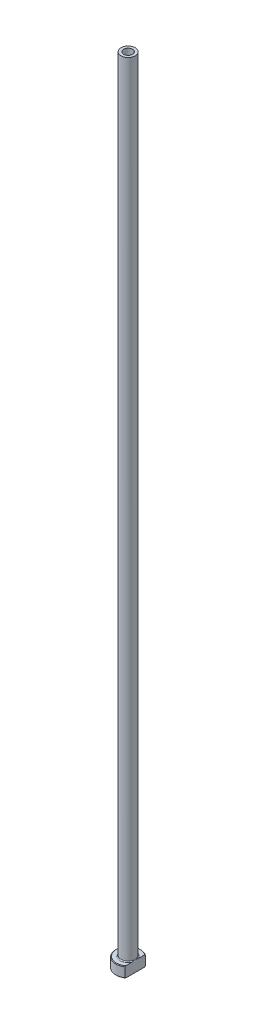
ISO-10303-21;
HEADER;
FILE_DESCRIPTION(('STEP AP214'),'2;1');
FILE_NAME('part.step','',(''),(''),'','','');
FILE_SCHEMA(('AUTOMOTIVE_DESIGN { 1 0 10303 214 1 1 1 1 }'));
ENDSEC;
DATA;
#1=APPLICATION_CONTEXT('core data for automotive mechanical design processes');
#2=APPLICATION_PROTOCOL_DEFINITION('international standard','automotive_design',2000,#1);
#3=PRODUCT_CONTEXT('',#1,'mechanical');
#4=PRODUCT('Part','Part','',(#3));
#5=PRODUCT_RELATED_PRODUCT_CATEGORY('part','',(#4));
#6=PRODUCT_DEFINITION_FORMATION('','',#4);
#7=PRODUCT_DEFINITION_CONTEXT('part definition',#1,'design');
#8=PRODUCT_DEFINITION('design','',#6,#7);
#9=PRODUCT_DEFINITION_SHAPE('','',#8);
#10=(LENGTH_UNIT() NAMED_UNIT(*) SI_UNIT(.MILLI.,.METRE.));
#11=(NAMED_UNIT(*) PLANE_ANGLE_UNIT() SI_UNIT($,.RADIAN.));
#12=(NAMED_UNIT(*) SI_UNIT($,.STERADIAN.) SOLID_ANGLE_UNIT());
#13=UNCERTAINTY_MEASURE_WITH_UNIT(LENGTH_MEASURE(1.E-05),#10,'distance_accuracy_value','');
#14=(GEOMETRIC_REPRESENTATION_CONTEXT(3) GLOBAL_UNCERTAINTY_ASSIGNED_CONTEXT((#13)) GLOBAL_UNIT_ASSIGNED_CONTEXT((#10,
#11,#12)) REPRESENTATION_CONTEXT('',''));
#15=CARTESIAN_POINT('',(0.,0.,0.));
#16=DIRECTION('',(0.,0.,1.));
#17=DIRECTION('',(1.,0.,0.));
#18=AXIS2_PLACEMENT_3D('',#15,#16,#17);
#19=CARTESIAN_POINT('',(0.,0.,0.));
#20=DIRECTION('',(0.,-1.,0.));
#21=DIRECTION('',(0.,0.,-1.));
#22=AXIS2_PLACEMENT_3D('',#19,#20,#21);
#23=PLANE('',#22);
#24=DIRECTION('',(0.,0.,-1.));
#25=VECTOR('',#24,1.);
#26=CARTESIAN_POINT('',(3.16865,0.,4.5564292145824));
#27=LINE('',#26,#25);
#28=CARTESIAN_POINT('',(3.16865,0.,4.2433729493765));
#29=VERTEX_POINT('',#28);
#30=CARTESIAN_POINT('',(3.16865,0.,-4.2433729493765));
#31=VERTEX_POINT('',#30);
#32=EDGE_CURVE('E79',#29,#31,#27,.T.);
#33=ORIENTED_EDGE('',*,*,#32,.F.);
#34=CARTESIAN_POINT('',(0.,0.,0.));
#35=DIRECTION('',(0.,-1.,0.));
#36=DIRECTION('',(0.,0.,-1.));
#37=AXIS2_PLACEMENT_3D('',#34,#35,#36);
#38=CIRCLE('',#37,5.29590000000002);
#39=EDGE_CURVE('E91',#29,#31,#38,.T.);
#40=ORIENTED_EDGE('',*,*,#39,.T.);
#41=EDGE_LOOP('',(#33,#40));
#42=FACE_BOUND('',#41,.T.);
#43=CARTESIAN_POINT('',(0.,0.,0.));
#44=DIRECTION('',(0.,-1.,0.));
#45=DIRECTION('',(0.,0.,-1.));
#46=AXIS2_PLACEMENT_3D('',#43,#44,#45);
#47=CIRCLE('',#46,2.57111500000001);
#48=CARTESIAN_POINT('',(0.,0.,-2.57111500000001));
#49=VERTEX_POINT('',#48);
#50=EDGE_CURVE('E157',#49,#49,#47,.T.);
#51=ORIENTED_EDGE('',*,*,#50,.F.);
#52=EDGE_LOOP('',(#51));
#53=FACE_BOUND('',#52,.T.);
#54=ADVANCED_FACE('F32',(#42,#53),#23,.T.);
#55=CARTESIAN_POINT('',(0.,0.,0.));
#56=DIRECTION('',(0.,-1.,0.));
#57=DIRECTION('',(0.,0.,-1.));
#58=AXIS2_PLACEMENT_3D('',#55,#56,#57);
#59=CYLINDRICAL_SURFACE('',#58,5.5499);
#60=DIRECTION('',(0.,-1.,0.));
#61=VECTOR('',#60,1.);
#62=CARTESIAN_POINT('',(3.16865,355.601,-4.5564292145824));
#63=LINE('',#62,#61);
#64=CARTESIAN_POINT('',(3.16865,4.49579999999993,-4.5564292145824));
#65=VERTEX_POINT('',#64);
#66=CARTESIAN_POINT('',(3.16865,0.253999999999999,-4.5564292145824));
#67=VERTEX_POINT('',#66);
#68=EDGE_CURVE('E108',#65,#67,#63,.T.);
#69=ORIENTED_EDGE('',*,*,#68,.T.);
#70=CARTESIAN_POINT('',(0.,0.253999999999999,0.));
#71=DIRECTION('',(0.,-1.,0.));
#72=DIRECTION('',(0.,0.,-1.));
#73=AXIS2_PLACEMENT_3D('',#70,#71,#72);
#74=CIRCLE('',#73,5.5499);
#75=CARTESIAN_POINT('',(3.16865,0.253999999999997,4.5564292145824));
#76=VERTEX_POINT('',#75);
#77=EDGE_CURVE('E40',#67,#76,#74,.F.);
#78=ORIENTED_EDGE('',*,*,#77,.T.);
#79=DIRECTION('',(0.,-1.,0.));
#80=VECTOR('',#79,1.);
#81=CARTESIAN_POINT('',(3.16865,355.601,4.5564292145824));
#82=LINE('',#81,#80);
#83=CARTESIAN_POINT('',(3.16865,4.49579999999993,4.5564292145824));
#84=VERTEX_POINT('',#83);
#85=EDGE_CURVE('E86',#84,#76,#82,.T.);
#86=ORIENTED_EDGE('',*,*,#85,.F.);
#87=CARTESIAN_POINT('',(0.,4.49579999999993,0.));
#88=DIRECTION('',(0.,1.,0.));
#89=DIRECTION('',(0.,0.,1.));
#90=AXIS2_PLACEMENT_3D('',#87,#88,#89);
#91=CIRCLE('',#90,5.5499);
#92=EDGE_CURVE('E95',#84,#65,#91,.F.);
#93=ORIENTED_EDGE('',*,*,#92,.T.);
#94=EDGE_LOOP('',(#69,#78,#86,#93));
#95=FACE_BOUND('',#94,.T.);
#96=ADVANCED_FACE('F106',(#95),#59,.T.);
#97=CARTESIAN_POINT('',(5.5499,4.7498,0.));
#98=DIRECTION('',(0.,1.,0.));
#99=DIRECTION('',(0.,0.,1.));
#100=AXIS2_PLACEMENT_3D('',#97,#98,#99);
#101=PLANE('',#100);
#102=DIRECTION('',(0.,0.,-1.));
#103=VECTOR('',#102,1.);
#104=CARTESIAN_POINT('',(3.16865,4.74980000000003,4.5564292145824));
#105=LINE('',#104,#103);
#106=CARTESIAN_POINT('',(3.16865,4.7498,-1.63481671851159));
#107=VERTEX_POINT('',#106);
#108=CARTESIAN_POINT('',(3.16865,4.7498,-4.24337294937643));
#109=VERTEX_POINT('',#108);
#110=EDGE_CURVE('E112',#107,#109,#105,.T.);
#111=ORIENTED_EDGE('',*,*,#110,.T.);
#112=CARTESIAN_POINT('',(0.,4.7498,0.));
#113=DIRECTION('',(0.,1.,0.));
#114=DIRECTION('',(0.,0.,1.));
#115=AXIS2_PLACEMENT_3D('',#112,#113,#114);
#116=CIRCLE('',#115,5.29589999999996);
#117=CARTESIAN_POINT('',(3.16865,4.7498,4.24337294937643));
#118=VERTEX_POINT('',#117);
#119=EDGE_CURVE('E11',#109,#118,#116,.T.);
#120=ORIENTED_EDGE('',*,*,#119,.T.);
#121=CARTESIAN_POINT('',(3.16864999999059,4.7498,1.63481671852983));
#122=VERTEX_POINT('',#121);
#123=EDGE_CURVE('E47',#118,#122,#105,.T.);
#124=ORIENTED_EDGE('',*,*,#123,.T.);
#125=CARTESIAN_POINT('',(0.,4.7498,0.));
#126=DIRECTION('',(0.,-1.,0.));
#127=DIRECTION('',(0.,0.,-1.));
#128=AXIS2_PLACEMENT_3D('',#125,#126,#127);
#129=CIRCLE('',#128,3.565525);
#130=EDGE_CURVE('E96',#122,#107,#129,.T.);
#131=ORIENTED_EDGE('',*,*,#130,.T.);
#132=EDGE_LOOP('',(#111,#120,#124,#131));
#133=FACE_BOUND('',#132,.T.);
#134=ADVANCED_FACE('F182',(#133),#101,.T.);
#135=CARTESIAN_POINT('',(0.,5.146675,0.));
#136=DIRECTION('',(0.,-1.,0.));
#137=DIRECTION('',(0.,0.,-1.));
#138=AXIS2_PLACEMENT_3D('',#135,#136,#137);
#139=TOROIDAL_SURFACE('',#138,3.565525,0.396875);
#140=CARTESIAN_POINT('',(3.16865,5.146675,0.));
#141=CARTESIAN_POINT('',(3.16865,5.14667428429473,4.66277788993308E-11));
#142=CARTESIAN_POINT('',(3.16865,5.14667356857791,-1.78482733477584E-07));
#143=CARTESIAN_POINT('',(3.16865,5.14667220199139,-7.25003186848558E-07));
#144=CARTESIAN_POINT('',(3.16865,5.14667155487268,-1.10030424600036E-06));
#145=CARTESIAN_POINT('',(3.16865,5.14667025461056,-1.99813404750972E-06));
#146=CARTESIAN_POINT('',(3.16865,5.14666960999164,-2.53289842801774E-06));
#147=CARTESIAN_POINT('',(3.16865,5.14666840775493,-3.67424467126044E-06));
#148=CARTESIAN_POINT('',(3.16865,5.14666784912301,-4.27981221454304E-06));
#149=CARTESIAN_POINT('',(3.16865,5.14666592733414,-6.49333135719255E-06));
#150=CARTESIAN_POINT('',(3.16865,5.14666466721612,-8.19260530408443E-06));
#151=CARTESIAN_POINT('',(3.16865,5.1466624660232,-1.16647175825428E-05));
#152=CARTESIAN_POINT('',(3.16865,5.14666151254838,-1.3430122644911E-05));
#153=CARTESIAN_POINT('',(3.16865,5.14665782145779,-2.04765522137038E-05));
#154=CARTESIAN_POINT('',(3.16865,5.14665525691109,-2.58538058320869E-05));
#155=CARTESIAN_POINT('',(3.16865,5.14665117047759,-3.63358801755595E-05));
#156=CARTESIAN_POINT('',(3.16865,5.14664956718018,-4.14096713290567E-05));
#157=CARTESIAN_POINT('',(3.16865,5.14664257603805,-6.34443713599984E-05));
#158=CARTESIAN_POINT('',(3.16865,5.14663713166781,-8.03743565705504E-05));
#159=CARTESIAN_POINT('',(3.16865,5.14662857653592,-0.000111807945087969));
#160=CARTESIAN_POINT('',(3.16865,5.146625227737,-0.000126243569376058));
#161=CARTESIAN_POINT('',(3.16865,5.14659823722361,-0.000232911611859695));
#162=CARTESIAN_POINT('',(3.16865,5.1465631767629,-0.000321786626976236));
#163=CARTESIAN_POINT('',(3.16865,5.14643076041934,-0.000670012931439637));
#164=CARTESIAN_POINT('',(3.16865,5.14634192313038,-0.000931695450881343));
#165=CARTESIAN_POINT('',(3.16865,5.14598882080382,-0.00195689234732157));
#166=CARTESIAN_POINT('',(3.16865,5.14571562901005,-0.00271802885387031));
#167=CARTESIAN_POINT('',(3.16865,5.14459471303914,-0.00585544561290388));
#168=CARTESIAN_POINT('',(3.16865,5.14375704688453,-0.00823433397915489));
#169=CARTESIAN_POINT('',(3.16865,5.13080352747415,-0.045002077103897));
#170=CARTESIAN_POINT('',(3.16865,5.11860522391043,-0.0793699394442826));
#171=CARTESIAN_POINT('',(3.16865,5.09480563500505,-0.146831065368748));
#172=CARTESIAN_POINT('',(3.16865,5.08319937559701,-0.17992273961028));
#173=CARTESIAN_POINT('',(3.16865,5.05872882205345,-0.250160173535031));
#174=CARTESIAN_POINT('',(3.16865,5.04588213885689,-0.287312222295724));
#175=CARTESIAN_POINT('',(3.16865,5.02034575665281,-0.362107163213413));
#176=CARTESIAN_POINT('',(3.16865,5.00765913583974,-0.399751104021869));
#177=CARTESIAN_POINT('',(3.16865,4.97701497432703,-0.492297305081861));
#178=CARTESIAN_POINT('',(3.16865,4.95928003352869,-0.547273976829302));
#179=CARTESIAN_POINT('',(3.16865,4.92542952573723,-0.656258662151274));
#180=CARTESIAN_POINT('',(3.16865,4.90928503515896,-0.710257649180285));
#181=CARTESIAN_POINT('',(3.16865,4.87522411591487,-0.83024121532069));
#182=CARTESIAN_POINT('',(3.16865,4.85766300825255,-0.896328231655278));
#183=CARTESIAN_POINT('',(3.16865,4.82539191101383,-1.02974197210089));
#184=CARTESIAN_POINT('',(3.16865,4.8107048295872,-1.09707431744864));
#185=CARTESIAN_POINT('',(3.16865,4.7843808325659,-1.23739352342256));
#186=CARTESIAN_POINT('',(3.16865,4.77304014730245,-1.31043808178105));
#187=CARTESIAN_POINT('',(3.16865,4.75646723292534,-1.45702765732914));
#188=CARTESIAN_POINT('',(3.16865,4.75121678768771,-1.53057051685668));
#189=CARTESIAN_POINT('',(3.16865,4.74889461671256,-1.67644419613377));
#190=CARTESIAN_POINT('',(3.16865,4.75166022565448,-1.74876957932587));
#191=CARTESIAN_POINT('',(3.16865,4.76391149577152,-1.85572284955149));
#192=CARTESIAN_POINT('',(3.16865,4.769266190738,-1.89082342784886));
#193=CARTESIAN_POINT('',(3.16865,4.78314258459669,-1.96037693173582));
#194=CARTESIAN_POINT('',(3.16865,4.79166022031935,-1.99483062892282));
#195=CARTESIAN_POINT('',(3.16865,4.80975826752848,-2.0535593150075));
#196=CARTESIAN_POINT('',(3.16865,4.81845399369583,-2.07810503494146));
#197=CARTESIAN_POINT('',(3.16865,4.83829308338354,-2.12629920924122));
#198=CARTESIAN_POINT('',(3.16865,4.84944408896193,-2.14994458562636));
#199=CARTESIAN_POINT('',(3.16865,4.87468634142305,-2.1958922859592));
#200=CARTESIAN_POINT('',(3.16865,4.88880103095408,-2.21818195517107));
#201=CARTESIAN_POINT('',(3.16865,4.92035751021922,-2.26026315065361));
#202=CARTESIAN_POINT('',(3.16865,4.93778918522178,-2.28006197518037));
#203=CARTESIAN_POINT('',(3.16865,4.96922967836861,-2.30918918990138));
#204=CARTESIAN_POINT('',(3.16865,4.98214531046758,-2.31969288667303));
#205=CARTESIAN_POINT('',(3.16865,5.00943424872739,-2.33863002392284));
#206=CARTESIAN_POINT('',(3.16865,5.02380699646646,-2.34706425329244));
#207=CARTESIAN_POINT('',(3.16865,5.05400337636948,-2.361360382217));
#208=CARTESIAN_POINT('',(3.16865,5.069841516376,-2.36719226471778));
#209=CARTESIAN_POINT('',(3.16865,5.10236414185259,-2.37556876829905));
#210=CARTESIAN_POINT('',(3.16865,5.11904735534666,-2.37811818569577));
#211=CARTESIAN_POINT('',(3.16865,5.15012257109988,-2.37953907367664));
#212=CARTESIAN_POINT('',(3.16865,5.1644940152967,-2.37889256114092));
#213=CARTESIAN_POINT('',(3.16865,5.19289291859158,-2.37506178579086));
#214=CARTESIAN_POINT('',(3.16865,5.20692032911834,-2.37187716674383));
#215=CARTESIAN_POINT('',(3.16865,5.23359936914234,-2.36343099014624));
#216=CARTESIAN_POINT('',(3.16865,5.24628466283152,-2.35827364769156));
#217=CARTESIAN_POINT('',(3.16865,5.27077987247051,-2.34620293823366));
#218=CARTESIAN_POINT('',(3.16865,5.28258955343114,-2.33928910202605));
#219=CARTESIAN_POINT('',(3.16865,5.31138945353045,-2.31987573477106));
#220=CARTESIAN_POINT('',(3.16865,5.32770979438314,-2.30638191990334));
#221=CARTESIAN_POINT('',(3.16865,5.35801888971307,-2.2769796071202));
#222=CARTESIAN_POINT('',(3.16865,5.37200054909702,-2.2610640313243));
#223=CARTESIAN_POINT('',(3.16865,5.40512341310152,-2.21806082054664));
#224=CARTESIAN_POINT('',(3.16865,5.42268309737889,-2.18976305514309));
#225=CARTESIAN_POINT('',(3.16865,5.45333663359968,-2.13094239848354));
#226=CARTESIAN_POINT('',(3.16865,5.46642934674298,-2.10041894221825));
#227=CARTESIAN_POINT('',(3.16865,5.48771138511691,-2.0415606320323));
#228=CARTESIAN_POINT('',(3.16865,5.49628469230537,-2.01336128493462));
#229=CARTESIAN_POINT('',(3.16865,5.51099656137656,-1.95632381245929));
#230=CARTESIAN_POINT('',(3.16865,5.51713302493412,-1.92748515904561));
#231=CARTESIAN_POINT('',(3.16865,5.53254859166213,-1.83974814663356));
#232=CARTESIAN_POINT('',(3.16865,5.5386185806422,-1.78028549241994));
#233=CARTESIAN_POINT('',(3.16865,5.54453876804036,-1.65829362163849));
#234=CARTESIAN_POINT('',(3.16865,5.54407710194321,-1.59575395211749));
#235=CARTESIAN_POINT('',(3.16865,5.53781271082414,-1.47080704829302));
#236=CARTESIAN_POINT('',(3.16865,5.53199591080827,-1.40840059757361));
#237=CARTESIAN_POINT('',(3.16865,5.5166154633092,-1.28746485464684));
#238=CARTESIAN_POINT('',(3.16865,5.50726872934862,-1.22890663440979));
#239=CARTESIAN_POINT('',(3.16865,5.48567786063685,-1.11272190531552));
#240=CARTESIAN_POINT('',(3.16865,5.47345247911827,-1.05509184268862));
#241=CARTESIAN_POINT('',(3.16865,5.44328051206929,-0.925795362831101));
#242=CARTESIAN_POINT('',(3.16865,5.42466959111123,-0.854285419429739));
#243=CARTESIAN_POINT('',(3.16865,5.39452813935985,-0.746782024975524));
#244=CARTESIAN_POINT('',(3.16865,5.38398071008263,-0.710505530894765));
#245=CARTESIAN_POINT('',(3.16865,5.36227217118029,-0.638036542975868));
#246=CARTESIAN_POINT('',(3.16865,5.35110958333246,-0.601844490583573));
#247=CARTESIAN_POINT('',(3.16865,5.32417385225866,-0.516533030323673));
#248=CARTESIAN_POINT('',(3.16865,5.3081950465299,-0.467478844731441));
#249=CARTESIAN_POINT('',(3.16865,5.27575939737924,-0.370102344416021));
#250=CARTESIAN_POINT('',(3.16865,5.25930934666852,-0.321777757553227));
#251=CARTESIAN_POINT('',(3.16865,5.22782288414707,-0.23048546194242));
#252=CARTESIAN_POINT('',(3.16865,5.21282608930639,-0.187503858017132));
#253=CARTESIAN_POINT('',(3.16865,5.18200013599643,-0.099892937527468));
#254=CARTESIAN_POINT('',(3.16865000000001,5.16616171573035,-0.0552666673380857));
#255=CARTESIAN_POINT('',(3.16865,5.14959263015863,-0.00823325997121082));
#256=CARTESIAN_POINT('',(3.16865,5.14875455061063,-0.00585332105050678));
#257=CARTESIAN_POINT('',(3.16865,5.14763353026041,-0.00271565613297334));
#258=CARTESIAN_POINT('',(3.16865,5.14736062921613,-0.00195532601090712));
#259=CARTESIAN_POINT('',(3.16865,5.1470078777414,-0.000931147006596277));
#260=CARTESIAN_POINT('',(3.16865,5.14691911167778,-0.000669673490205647));
#261=CARTESIAN_POINT('',(3.16865,5.14678678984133,-0.000321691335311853));
#262=CARTESIAN_POINT('',(3.16865,5.14675174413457,-0.000232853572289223));
#263=CARTESIAN_POINT('',(3.16865,5.146724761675,-0.000126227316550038));
#264=CARTESIAN_POINT('',(3.16865,5.14672141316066,-0.000111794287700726));
#265=CARTESIAN_POINT('',(3.16865,5.14671285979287,-8.03665096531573E-05));
#266=CARTESIAN_POINT('',(3.16865,5.14670741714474,-6.3439670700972E-05));
#267=CARTESIAN_POINT('',(3.16865,5.14670042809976,-4.14084906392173E-05));
#268=CARTESIAN_POINT('',(3.16865,5.1466988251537,-3.63350825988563E-05));
#269=CARTESIAN_POINT('',(3.16865,5.14669473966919,-2.5853746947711E-05));
#270=CARTESIAN_POINT('',(3.16865,5.1466921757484,-2.0476833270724E-05));
#271=CARTESIAN_POINT('',(3.16865,5.14668848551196,-1.34307327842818E-05));
#272=CARTESIAN_POINT('',(3.16865,5.1466875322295,-1.16653571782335E-05));
#273=CARTESIAN_POINT('',(3.16865,5.14668533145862,-8.19326689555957E-06));
#274=CARTESIAN_POINT('',(3.16865,5.14668407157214,-6.49398299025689E-06));
#275=CARTESIAN_POINT('',(3.16865,5.1466821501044,-4.28040648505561E-06));
#276=CARTESIAN_POINT('',(3.16865,5.14668159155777,-3.67481344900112E-06));
#277=CARTESIAN_POINT('',(3.16865,5.14668038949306,-2.5334008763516E-06));
#278=CARTESIAN_POINT('',(3.16865,5.1466797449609,-1.99859540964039E-06));
#279=CARTESIAN_POINT('',(3.16865,5.14667844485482,-1.10066675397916E-06));
#280=CARTESIAN_POINT('',(3.16865,5.14667779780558,-7.25310433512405E-07));
#281=CARTESIAN_POINT('',(3.16865,5.14667643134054,-1.78654653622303E-07));
#282=CARTESIAN_POINT('',(3.16865,5.14667571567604,-4.66240653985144E-11));
#283=CARTESIAN_POINT('',(3.16865,5.146675,0.));
#284=B_SPLINE_CURVE_WITH_KNOTS('',3,(#140,#141,#142,#143,#144,#145,#146,#147,#148,#149,#150,
#151,#152,#153,#154,#155,#156,#157,#158,#159,#160,#161,#162,#163,#164,#165,#166,#167,#168,#169,
#170,#171,#172,#173,#174,#175,#176,#177,#178,#179,#180,#181,#182,#183,#184,#185,#186,#187,#188,
#189,#190,#191,#192,#193,#194,#195,#196,#197,#198,#199,#200,#201,#202,#203,#204,#205,#206,#207,
#208,#209,#210,#211,#212,#213,#214,#215,#216,#217,#218,#219,#220,#221,#222,#223,#224,#225,#226,
#227,#228,#229,#230,#231,#232,#233,#234,#235,#236,#237,#238,#239,#240,#241,#242,#243,#244,#245,
#246,#247,#248,#249,#250,#251,#252,#253,#254,#255,#256,#257,#258,#259,#260,#261,#262,#263,#264,
#265,#266,#267,#268,#269,#270,#271,#272,#273,#274,#275,#276,#277,#278,#279,#280,#281,#282,#283),
.UNSPECIFIED.,.T.,.F.,(4,2,2,2,2,2,2,2,2,2,2,2,2,2,2,2,2,2,2,2,2,2,2,2,2,2,2,2,2,2,2,2,2,2,2,2,
2,2,2,2,2,2,2,2,2,2,2,2,2,2,2,2,2,2,2,2,2,2,2,2,2,2,2,2,2,2,2,2,2,2,2,4),(0.,
2.1481731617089E-06,4.3824835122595E-06,6.8838453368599E-06,9.35297220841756E-06,
1.56702799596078E-05,2.16847026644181E-05,3.95092655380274E-05,5.54549698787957E-05,
0.000108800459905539,0.000153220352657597,0.00043893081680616,0.0012687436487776,
0.00369382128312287,0.0112610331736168,0.120656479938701,0.225862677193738,0.343792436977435,
0.46296418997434,0.636252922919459,0.805320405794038,1.0104086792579,1.21707043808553,
1.43863106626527,1.65952727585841,1.87597253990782,1.98238468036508,2.08866059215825,
2.16668016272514,2.24494609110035,2.3238561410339,2.40252931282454,2.45231667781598,
2.50208503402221,2.55241348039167,2.60266830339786,2.6455965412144,2.68853080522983,
2.72945503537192,2.77039020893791,2.83355766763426,2.89691341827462,2.9962630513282,
3.09563799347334,3.18393132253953,3.27230051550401,3.45109061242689,3.63844500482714,
3.82629323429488,4.00409983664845,4.18077867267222,4.40237617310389,4.51570920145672,
4.62932757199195,4.7840943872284,4.93723393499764,5.07380463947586,5.21585219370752,
5.22342277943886,5.22584528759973,5.22667443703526,5.22696002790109,5.22700444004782,
5.22705777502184,5.22707371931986,5.22709154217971,5.2270975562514,5.22710387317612,
5.22710634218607,5.22710884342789,5.22711107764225,5.22711322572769),.UNSPECIFIED.);
#285=CARTESIAN_POINT('',(3.16865,5.146675,0.));
#286=VERTEX_POINT('',#285);
#287=EDGE_CURVE('E134',#286,#107,#284,.T.);
#288=ORIENTED_EDGE('',*,*,#287,.T.);
#289=ORIENTED_EDGE('',*,*,#130,.F.);
#290=CARTESIAN_POINT('',(3.16865,5.146675,0.));
#291=CARTESIAN_POINT('',(3.16865,5.14667571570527,-4.6625972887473E-11));
#292=CARTESIAN_POINT('',(3.16865,5.14667643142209,1.78482735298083E-07));
#293=CARTESIAN_POINT('',(3.16865,5.14667779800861,7.25003188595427E-07));
#294=CARTESIAN_POINT('',(3.16865,5.14667844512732,1.10030424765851E-06));
#295=CARTESIAN_POINT('',(3.16865,5.14667974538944,1.99813404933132E-06));
#296=CARTESIAN_POINT('',(3.16865,5.14668039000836,2.53289843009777E-06));
#297=CARTESIAN_POINT('',(3.16865,5.14668159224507,3.67424467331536E-06));
#298=CARTESIAN_POINT('',(3.16865,5.14668215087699,4.27981221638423E-06));
#299=CARTESIAN_POINT('',(3.16865,5.14668407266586,6.49333135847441E-06));
#300=CARTESIAN_POINT('',(3.16865,5.14668533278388,8.1926053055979E-06));
#301=CARTESIAN_POINT('',(3.16865,5.1466875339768,1.16647175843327E-05));
#302=CARTESIAN_POINT('',(3.16865,5.14668848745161,1.3430122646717E-05));
#303=CARTESIAN_POINT('',(3.16865,5.1466921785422,2.04765522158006E-05));
#304=CARTESIAN_POINT('',(3.16865,5.14669474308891,2.58538058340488E-05));
#305=CARTESIAN_POINT('',(3.16865,5.14669882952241,3.63358801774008E-05));
#306=CARTESIAN_POINT('',(3.16865,5.14670043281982,4.14096713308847E-05));
#307=CARTESIAN_POINT('',(3.16865,5.14670742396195,6.34443713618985E-05));
#308=CARTESIAN_POINT('',(3.16865,5.14671286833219,8.03743565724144E-05));
#309=CARTESIAN_POINT('',(3.16865,5.14672142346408,0.000111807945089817));
#310=CARTESIAN_POINT('',(3.16865,5.14672477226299,0.00012624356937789));
#311=CARTESIAN_POINT('',(3.16865,5.14675176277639,0.000232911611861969));
#312=CARTESIAN_POINT('',(3.16865,5.1467868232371,0.000321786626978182));
#313=CARTESIAN_POINT('',(3.16865,5.14691923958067,0.000670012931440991));
#314=CARTESIAN_POINT('',(3.16865,5.14700807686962,0.000931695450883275));
#315=CARTESIAN_POINT('',(3.16865,5.14736117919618,0.00195689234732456));
#316=CARTESIAN_POINT('',(3.16865,5.14763437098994,0.00271802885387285));
#317=CARTESIAN_POINT('',(3.16865,5.14875528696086,0.00585544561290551));
#318=CARTESIAN_POINT('',(3.16865,5.14959295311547,0.00823433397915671));
#319=CARTESIAN_POINT('',(3.16865,5.16254647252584,0.0450020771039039));
#320=CARTESIAN_POINT('',(3.16865,5.17474477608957,0.0793699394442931));
#321=CARTESIAN_POINT('',(3.16865,5.19854436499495,0.146831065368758));
#322=CARTESIAN_POINT('',(3.16865,5.21015062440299,0.179922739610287));
#323=CARTESIAN_POINT('',(3.16865,5.23462117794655,0.250160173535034));
#324=CARTESIAN_POINT('',(3.16865,5.24746786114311,0.287312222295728));
#325=CARTESIAN_POINT('',(3.16865,5.27300424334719,0.362107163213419));
#326=CARTESIAN_POINT('',(3.16865,5.28569086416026,0.399751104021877));
#327=CARTESIAN_POINT('',(3.16865,5.31633502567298,0.492297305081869));
#328=CARTESIAN_POINT('',(3.16865,5.33406996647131,0.54727397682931));
#329=CARTESIAN_POINT('',(3.16865,5.36792047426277,0.656258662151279));
#330=CARTESIAN_POINT('',(3.16865,5.38406496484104,0.710257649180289));
#331=CARTESIAN_POINT('',(3.16865,5.41812588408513,0.830241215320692));
#332=CARTESIAN_POINT('',(3.16865,5.43568699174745,0.896328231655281));
#333=CARTESIAN_POINT('',(3.16865,5.46795808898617,1.02974197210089));
#334=CARTESIAN_POINT('',(3.16865,5.4826451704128,1.09707431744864));
#335=CARTESIAN_POINT('',(3.16865,5.5089691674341,1.23739352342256));
#336=CARTESIAN_POINT('',(3.16865,5.52030985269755,1.31043808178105));
#337=CARTESIAN_POINT('',(3.16865,5.53688276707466,1.45702765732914));
#338=CARTESIAN_POINT('',(3.16865,5.54213321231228,1.53057051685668));
#339=CARTESIAN_POINT('',(3.16865,5.54445538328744,1.67644419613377));
#340=CARTESIAN_POINT('',(3.16865,5.54168977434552,1.74876957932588));
#341=CARTESIAN_POINT('',(3.16865,5.52943850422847,1.8557228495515));
#342=CARTESIAN_POINT('',(3.16865,5.52408380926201,1.89082342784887));
#343=CARTESIAN_POINT('',(3.16865,5.51020741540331,1.96037693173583));
#344=CARTESIAN_POINT('',(3.16865,5.50168977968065,1.99483062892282));
#345=CARTESIAN_POINT('',(3.16865,5.48359173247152,2.0535593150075));
#346=CARTESIAN_POINT('',(3.16865,5.47489600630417,2.07810503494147));
#347=CARTESIAN_POINT('',(3.16865,5.45505691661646,2.12629920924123));
#348=CARTESIAN_POINT('',(3.16865,5.44390591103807,2.14994458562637));
#349=CARTESIAN_POINT('',(3.16865,5.41866365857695,2.1958922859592));
#350=CARTESIAN_POINT('',(3.16865,5.40454896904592,2.21818195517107));
#351=CARTESIAN_POINT('',(3.16865,5.37299248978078,2.26026315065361));
#352=CARTESIAN_POINT('',(3.16865,5.35556081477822,2.28006197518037));
#353=CARTESIAN_POINT('',(3.16865,5.32412032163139,2.30918918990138));
#354=CARTESIAN_POINT('',(3.16865,5.31120468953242,2.31969288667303));
#355=CARTESIAN_POINT('',(3.16865,5.28391575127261,2.33863002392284));
#356=CARTESIAN_POINT('',(3.16865,5.26954300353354,2.34706425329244));
#357=CARTESIAN_POINT('',(3.16865,5.23934662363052,2.361360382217));
#358=CARTESIAN_POINT('',(3.16865,5.223508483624,2.36719226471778));
#359=CARTESIAN_POINT('',(3.16865,5.19098585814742,2.37556876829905));
#360=CARTESIAN_POINT('',(3.16865,5.17430264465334,2.37811818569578));
#361=CARTESIAN_POINT('',(3.16865,5.14322742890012,2.37953907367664));
#362=CARTESIAN_POINT('',(3.16865,5.1288559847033,2.37889256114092));
#363=CARTESIAN_POINT('',(3.16865,5.10045708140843,2.37506178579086));
#364=CARTESIAN_POINT('',(3.16865,5.08642967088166,2.37187716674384));
#365=CARTESIAN_POINT('',(3.16865,5.05975063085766,2.36343099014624));
#366=CARTESIAN_POINT('',(3.16865,5.04706533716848,2.35827364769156));
#367=CARTESIAN_POINT('',(3.16865,5.02257012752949,2.34620293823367));
#368=CARTESIAN_POINT('',(3.16865,5.01076044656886,2.33928910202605));
#369=CARTESIAN_POINT('',(3.16865,4.98196054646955,2.31987573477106));
#370=CARTESIAN_POINT('',(3.16865,4.96564020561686,2.30638191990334));
#371=CARTESIAN_POINT('',(3.16865,4.93533111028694,2.2769796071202));
#372=CARTESIAN_POINT('',(3.16865,4.92134945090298,2.2610640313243));
#373=CARTESIAN_POINT('',(3.16865,4.88822658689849,2.21806082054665));
#374=CARTESIAN_POINT('',(3.16865,4.87066690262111,2.18976305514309));
#375=CARTESIAN_POINT('',(3.16865,4.84001336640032,2.13094239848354));
#376=CARTESIAN_POINT('',(3.16865,4.82692065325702,2.10041894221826));
#377=CARTESIAN_POINT('',(3.16865,4.80563861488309,2.04156063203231));
#378=CARTESIAN_POINT('',(3.16865,4.79706530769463,2.01336128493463));
#379=CARTESIAN_POINT('',(3.16865,4.78235343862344,1.9563238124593));
#380=CARTESIAN_POINT('',(3.16865,4.77621697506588,1.92748515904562));
#381=CARTESIAN_POINT('',(3.16865,4.76080140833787,1.83974814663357));
#382=CARTESIAN_POINT('',(3.16865,4.7547314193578,1.78028549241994));
#383=CARTESIAN_POINT('',(3.16865,4.74881123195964,1.6582936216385));
#384=CARTESIAN_POINT('',(3.16865,4.74927289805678,1.5957539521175));
#385=CARTESIAN_POINT('',(3.16865,4.75553728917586,1.47080704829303));
#386=CARTESIAN_POINT('',(3.16865,4.76135408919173,1.40840059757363));
#387=CARTESIAN_POINT('',(3.16865,4.7767345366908,1.28746485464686));
#388=CARTESIAN_POINT('',(3.16865,4.78608127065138,1.22890663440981));
#389=CARTESIAN_POINT('',(3.16865,4.80767213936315,1.11272190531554));
#390=CARTESIAN_POINT('',(3.16865,4.81989752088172,1.05509184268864));
#391=CARTESIAN_POINT('',(3.16865,4.85006948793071,0.925795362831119));
#392=CARTESIAN_POINT('',(3.16865,4.86868040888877,0.854285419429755));
#393=CARTESIAN_POINT('',(3.16865,4.89882186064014,0.746782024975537));
#394=CARTESIAN_POINT('',(3.16865,4.90936928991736,0.710505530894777));
#395=CARTESIAN_POINT('',(3.16865,4.9310778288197,0.638036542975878));
#396=CARTESIAN_POINT('',(3.16865,4.94224041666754,0.601844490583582));
#397=CARTESIAN_POINT('',(3.16865,4.96917614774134,0.516533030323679));
#398=CARTESIAN_POINT('',(3.16865,4.98515495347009,0.467478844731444));
#399=CARTESIAN_POINT('',(3.16865,5.01759060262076,0.370102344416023));
#400=CARTESIAN_POINT('',(3.16865,5.03404065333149,0.321777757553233));
#401=CARTESIAN_POINT('',(3.16865,5.06552711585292,0.230485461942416));
#402=CARTESIAN_POINT('',(3.16865,5.08052391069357,0.187503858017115));
#403=CARTESIAN_POINT('',(3.16865,5.11134986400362,0.0998929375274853));
#404=CARTESIAN_POINT('',(3.16865,5.12718828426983,0.0552666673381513));
#405=CARTESIAN_POINT('',(3.16865,5.14375736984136,0.00823325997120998));
#406=CARTESIAN_POINT('',(3.16865,5.14459544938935,0.00585332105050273));
#407=CARTESIAN_POINT('',(3.16865,5.1457164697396,0.00271565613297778));
#408=CARTESIAN_POINT('',(3.16865,5.14598937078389,0.00195532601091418));
#409=CARTESIAN_POINT('',(3.16865,5.14634212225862,0.0009311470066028));
#410=CARTESIAN_POINT('',(3.16865,5.14643088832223,0.000669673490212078));
#411=CARTESIAN_POINT('',(3.16865,5.14656321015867,0.000321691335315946));
#412=CARTESIAN_POINT('',(3.16865,5.14659825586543,0.000232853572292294));
#413=CARTESIAN_POINT('',(3.16865,5.146625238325,0.000126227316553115));
#414=CARTESIAN_POINT('',(3.16865,5.14662858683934,0.000111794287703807));
#415=CARTESIAN_POINT('',(3.16865,5.14663714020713,8.03665096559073E-05));
#416=CARTESIAN_POINT('',(3.16865,5.14664258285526,6.34396707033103E-05));
#417=CARTESIAN_POINT('',(3.16865,5.14664957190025,4.14084906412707E-05));
#418=CARTESIAN_POINT('',(3.16865,5.1466511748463,3.63350826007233E-05));
#419=CARTESIAN_POINT('',(3.16865,5.14665526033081,2.58537469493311E-05));
#420=CARTESIAN_POINT('',(3.16865,5.1466578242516,2.04768332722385E-05));
#421=CARTESIAN_POINT('',(3.16865,5.14666151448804,1.34307327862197E-05));
#422=CARTESIAN_POINT('',(3.16865,5.1466624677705,1.16653571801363E-05));
#423=CARTESIAN_POINT('',(3.16865,5.14666466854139,8.19326689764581E-06));
#424=CARTESIAN_POINT('',(3.16865,5.14666592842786,6.49398299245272E-06));
#425=CARTESIAN_POINT('',(3.16865,5.1466678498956,4.28040648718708E-06));
#426=CARTESIAN_POINT('',(3.16865,5.14666840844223,3.67481345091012E-06));
#427=CARTESIAN_POINT('',(3.16865,5.14666961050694,2.53340087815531E-06));
#428=CARTESIAN_POINT('',(3.16865,5.1466702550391,1.99859541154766E-06));
#429=CARTESIAN_POINT('',(3.16865,5.14667155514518,1.10066675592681E-06));
#430=CARTESIAN_POINT('',(3.16865,5.14667220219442,7.2531043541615E-07));
#431=CARTESIAN_POINT('',(3.16865,5.14667356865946,1.7865465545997E-07));
#432=CARTESIAN_POINT('',(3.16865,5.14667428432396,4.66258784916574E-11));
#433=CARTESIAN_POINT('',(3.16865,5.146675,0.));
#434=B_SPLINE_CURVE_WITH_KNOTS('',3,(#290,#291,#292,#293,#294,#295,#296,#297,#298,#299,#300,
#301,#302,#303,#304,#305,#306,#307,#308,#309,#310,#311,#312,#313,#314,#315,#316,#317,#318,#319,
#320,#321,#322,#323,#324,#325,#326,#327,#328,#329,#330,#331,#332,#333,#334,#335,#336,#337,#338,
#339,#340,#341,#342,#343,#344,#345,#346,#347,#348,#349,#350,#351,#352,#353,#354,#355,#356,#357,
#358,#359,#360,#361,#362,#363,#364,#365,#366,#367,#368,#369,#370,#371,#372,#373,#374,#375,#376,
#377,#378,#379,#380,#381,#382,#383,#384,#385,#386,#387,#388,#389,#390,#391,#392,#393,#394,#395,
#396,#397,#398,#399,#400,#401,#402,#403,#404,#405,#406,#407,#408,#409,#410,#411,#412,#413,#414,
#415,#416,#417,#418,#419,#420,#421,#422,#423,#424,#425,#426,#427,#428,#429,#430,#431,#432,#433),
.UNSPECIFIED.,.T.,.F.,(4,2,2,2,2,2,2,2,2,2,2,2,2,2,2,2,2,2,2,2,2,2,2,2,2,2,2,2,2,2,2,2,2,2,2,2,
2,2,2,2,2,2,2,2,2,2,2,2,2,2,2,2,2,2,2,2,2,2,2,2,2,2,2,2,2,2,2,2,2,2,2,4),(0.,
2.14817316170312E-06,4.38248351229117E-06,6.88384533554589E-06,9.3529722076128E-06,
1.56702799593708E-05,2.16847026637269E-05,3.95092655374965E-05,5.54549698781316E-05,
0.000108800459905,0.000153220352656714,0.000438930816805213,0.00126874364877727,
0.00369382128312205,0.0112610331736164,0.120656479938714,0.225862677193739,0.343792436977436,
0.462964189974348,0.636252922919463,0.80532040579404,1.0104086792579,1.21707043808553,
1.43863106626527,1.65952727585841,1.87597253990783,1.98238468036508,2.08866059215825,
2.16668016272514,2.24494609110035,2.3238561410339,2.40252931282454,2.45231667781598,
2.5020850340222,2.55241348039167,2.60266830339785,2.64559654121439,2.68853080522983,
2.72945503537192,2.77039020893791,2.83355766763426,2.89691341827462,2.99626305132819,
3.09563799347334,3.18393132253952,3.272300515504,3.45109061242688,3.63844500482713,
3.82629323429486,4.00409983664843,4.1807786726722,4.40237617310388,4.51570920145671,
4.62932757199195,4.7840943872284,4.93723393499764,5.07380463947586,5.21585219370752,
5.22342277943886,5.22584528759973,5.22667443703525,5.22696002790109,5.22700444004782,
5.22705777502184,5.22707371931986,5.22709154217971,5.2270975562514,5.22710387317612,
5.22710634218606,5.22710884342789,5.22711107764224,5.22711322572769),.UNSPECIFIED.);
#435=EDGE_CURVE('E139',#122,#286,#434,.T.);
#436=ORIENTED_EDGE('',*,*,#435,.T.);
#437=CARTESIAN_POINT('',(0.,5.146675,0.));
#438=DIRECTION('',(0.,-1.,0.));
#439=DIRECTION('',(0.,0.,-1.));
#440=AXIS2_PLACEMENT_3D('',#437,#438,#439);
#441=CIRCLE('',#440,3.16865);
#442=EDGE_CURVE('E101',#286,#286,#441,.T.);
#443=ORIENTED_EDGE('',*,*,#442,.T.);
#444=EDGE_LOOP('',(#288,#289,#436,#443));
#445=FACE_BOUND('',#444,.T.);
#446=ADVANCED_FACE('F166',(#445),#139,.F.);
#447=CARTESIAN_POINT('',(0.,0.,0.));
#448=DIRECTION('',(0.,-1.,0.));
#449=DIRECTION('',(0.,0.,-1.));
#450=AXIS2_PLACEMENT_3D('',#447,#448,#449);
#451=CYLINDRICAL_SURFACE('',#450,3.16865);
#452=CARTESIAN_POINT('',(0.,355.6,0.));
#453=DIRECTION('',(0.,-1.,0.));
#454=DIRECTION('',(0.,0.,-1.));
#455=AXIS2_PLACEMENT_3D('',#452,#453,#454);
#456=CIRCLE('',#455,3.16865);
#457=CARTESIAN_POINT('',(0.,355.6,-3.16865));
#458=VERTEX_POINT('',#457);
#459=EDGE_CURVE('E160',#458,#458,#456,.T.);
#460=ORIENTED_EDGE('',*,*,#459,.T.);
#461=EDGE_LOOP('',(#460));
#462=FACE_BOUND('',#461,.T.);
#463=ORIENTED_EDGE('',*,*,#442,.F.);
#464=EDGE_LOOP('',(#463));
#465=FACE_BOUND('',#464,.T.);
#466=ADVANCED_FACE('F169',(#462,#465),#451,.T.);
#467=CARTESIAN_POINT('',(3.16865,355.6,0.));
#468=DIRECTION('',(0.,1.,0.));
#469=DIRECTION('',(0.,0.,1.));
#470=AXIS2_PLACEMENT_3D('',#467,#468,#469);
#471=PLANE('',#470);
#472=CARTESIAN_POINT('',(0.,355.6,0.));
#473=DIRECTION('',(0.,-1.,0.));
#474=DIRECTION('',(0.,0.,-1.));
#475=AXIS2_PLACEMENT_3D('',#472,#473,#474);
#476=CIRCLE('',#475,1.98374);
#477=CARTESIAN_POINT('',(0.,355.6,-1.98374));
#478=VERTEX_POINT('',#477);
#479=EDGE_CURVE('E145',#478,#478,#476,.T.);
#480=ORIENTED_EDGE('',*,*,#479,.T.);
#481=EDGE_LOOP('',(#480));
#482=FACE_BOUND('',#481,.T.);
#483=ORIENTED_EDGE('',*,*,#459,.F.);
#484=EDGE_LOOP('',(#483));
#485=FACE_BOUND('',#484,.T.);
#486=ADVANCED_FACE('F171',(#482,#485),#471,.T.);
#487=CARTESIAN_POINT('',(0.,0.,0.));
#488=DIRECTION('',(0.,-1.,0.));
#489=DIRECTION('',(0.,0.,-1.));
#490=AXIS2_PLACEMENT_3D('',#487,#488,#489);
#491=CONICAL_SURFACE('',#490,2.57111500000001,0.785398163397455);
#492=CARTESIAN_POINT('',(0.,0.396875,0.));
#493=DIRECTION('',(0.,-1.,0.));
#494=DIRECTION('',(0.,0.,-1.));
#495=AXIS2_PLACEMENT_3D('',#492,#493,#494);
#496=CIRCLE('',#495,2.17424);
#497=CARTESIAN_POINT('',(0.,0.396875,-2.17424));
#498=VERTEX_POINT('',#497);
#499=EDGE_CURVE('E154',#498,#498,#496,.T.);
#500=ORIENTED_EDGE('',*,*,#499,.F.);
#501=EDGE_LOOP('',(#500));
#502=FACE_BOUND('',#501,.T.);
#503=ORIENTED_EDGE('',*,*,#50,.T.);
#504=EDGE_LOOP('',(#503));
#505=FACE_BOUND('',#504,.T.);
#506=ADVANCED_FACE('F179',(#502,#505),#491,.F.);
#507=CARTESIAN_POINT('',(0.,0.,0.));
#508=DIRECTION('',(0.,-1.,0.));
#509=DIRECTION('',(0.,0.,-1.));
#510=AXIS2_PLACEMENT_3D('',#507,#508,#509);
#511=CYLINDRICAL_SURFACE('',#510,2.17424);
#512=CARTESIAN_POINT('',(0.,281.1145,0.));
#513=DIRECTION('',(0.,-1.,0.));
#514=DIRECTION('',(0.,0.,-1.));
#515=AXIS2_PLACEMENT_3D('',#512,#513,#514);
#516=CIRCLE('',#515,2.17424);
#517=CARTESIAN_POINT('',(0.,281.1145,-2.17424));
#518=VERTEX_POINT('',#517);
#519=EDGE_CURVE('E151',#518,#518,#516,.T.);
#520=ORIENTED_EDGE('',*,*,#519,.F.);
#521=EDGE_LOOP('',(#520));
#522=FACE_BOUND('',#521,.T.);
#523=ORIENTED_EDGE('',*,*,#499,.T.);
#524=EDGE_LOOP('',(#523));
#525=FACE_BOUND('',#524,.T.);
#526=ADVANCED_FACE('F202',(#522,#525),#511,.F.);
#527=CARTESIAN_POINT('',(0.,281.1145,0.));
#528=DIRECTION('',(0.,-1.,0.));
#529=DIRECTION('',(0.,0.,-1.));
#530=AXIS2_PLACEMENT_3D('',#527,#528,#529);
#531=CONICAL_SURFACE('',#530,2.17424,0.0133325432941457);
#532=CARTESIAN_POINT('',(0.,295.402,0.));
#533=DIRECTION('',(0.,-1.,0.));
#534=DIRECTION('',(0.,0.,-1.));
#535=AXIS2_PLACEMENT_3D('',#532,#533,#534);
#536=CIRCLE('',#535,1.98374);
#537=CARTESIAN_POINT('',(0.,295.402,-1.98374));
#538=VERTEX_POINT('',#537);
#539=EDGE_CURVE('E148',#538,#538,#536,.T.);
#540=ORIENTED_EDGE('',*,*,#539,.F.);
#541=EDGE_LOOP('',(#540));
#542=FACE_BOUND('',#541,.T.);
#543=ORIENTED_EDGE('',*,*,#519,.T.);
#544=EDGE_LOOP('',(#543));
#545=FACE_BOUND('',#544,.T.);
#546=ADVANCED_FACE('F198',(#542,#545),#531,.F.);
#547=CARTESIAN_POINT('',(0.,0.,0.));
#548=DIRECTION('',(0.,-1.,0.));
#549=DIRECTION('',(0.,0.,-1.));
#550=AXIS2_PLACEMENT_3D('',#547,#548,#549);
#551=CYLINDRICAL_SURFACE('',#550,1.98374);
#552=ORIENTED_EDGE('',*,*,#479,.F.);
#553=EDGE_LOOP('',(#552));
#554=FACE_BOUND('',#553,.T.);
#555=ORIENTED_EDGE('',*,*,#539,.T.);
#556=EDGE_LOOP('',(#555));
#557=FACE_BOUND('',#556,.T.);
#558=ADVANCED_FACE('F192',(#554,#557),#551,.F.);
#559=CARTESIAN_POINT('',(0.,0.,0.));
#560=DIRECTION('',(0.,1.,0.));
#561=DIRECTION('',(0.,0.,1.));
#562=AXIS2_PLACEMENT_3D('',#559,#560,#561);
#563=CONICAL_SURFACE('',#562,5.29590000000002,0.785398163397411);
#564=CARTESIAN_POINT('',(3.16865,5.21934600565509,-10.0264677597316));
#565=CARTESIAN_POINT('',(3.16865,5.04972214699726,-9.84857079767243));
#566=CARTESIAN_POINT('',(3.16865,4.88030851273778,-9.67047319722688));
#567=CARTESIAN_POINT('',(3.16865,4.54198482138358,-9.31379820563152));
#568=CARTESIAN_POINT('',(3.16865,4.37307476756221,-9.13522081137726));
#569=CARTESIAN_POINT('',(3.16865,3.86712349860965,-8.5985438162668));
#570=CARTESIAN_POINT('',(3.16865,3.53096637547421,-8.23960952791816));
#571=CARTESIAN_POINT('',(3.16865,2.85879335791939,-7.51513592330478));
#572=CARTESIAN_POINT('',(3.16865,2.52281002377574,-7.14956628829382));
#573=CARTESIAN_POINT('',(3.16865,2.02281291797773,-6.59766681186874));
#574=CARTESIAN_POINT('',(3.16865,1.85682540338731,-6.41312675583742));
#575=CARTESIAN_POINT('',(3.16865,1.52653705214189,-6.04254642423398));
#576=CARTESIAN_POINT('',(3.16865,1.36223619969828,-5.85650616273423));
#577=CARTESIAN_POINT('',(3.16865,0.981850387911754,-5.42076114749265));
#578=CARTESIAN_POINT('',(3.16865,0.766591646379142,-5.17033049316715));
#579=CARTESIAN_POINT('',(3.16865,0.447835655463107,-4.79111624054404));
#580=CARTESIAN_POINT('',(3.16865,0.342249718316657,-4.66408862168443));
#581=CARTESIAN_POINT('',(3.16865,0.132808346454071,-4.40861638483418));
#582=CARTESIAN_POINT('',(3.16865,0.0289528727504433,-4.28017179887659));
#583=CARTESIAN_POINT('',(3.16865,-0.176378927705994,-4.02185059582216));
#584=CARTESIAN_POINT('',(3.16865,-0.277859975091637,-3.89197773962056));
#585=CARTESIAN_POINT('',(3.16865,-0.478096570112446,-3.63015262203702));
#586=CARTESIAN_POINT('',(3.16865,-0.576852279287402,-3.49820048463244));
#587=CARTESIAN_POINT('',(3.16865,-0.770790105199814,-3.23181279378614));
#588=CARTESIAN_POINT('',(3.16865,-0.865974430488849,-3.09737885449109));
#589=CARTESIAN_POINT('',(3.16865,-1.05171285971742,-2.8253620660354));
#590=CARTESIAN_POINT('',(3.16865,-1.14226785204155,-2.68777982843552));
#591=CARTESIAN_POINT('',(3.16865,-1.29764363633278,-2.43984265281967));
#592=CARTESIAN_POINT('',(3.16865,-1.36369752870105,-2.33026348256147));
#593=CARTESIAN_POINT('',(3.16865,-1.49102371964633,-2.10831921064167));
#594=CARTESIAN_POINT('',(3.16865,-1.55229535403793,-1.99595372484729));
#595=CARTESIAN_POINT('',(3.16865,-1.66865027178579,-1.76810298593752));
#596=CARTESIAN_POINT('',(3.16865,-1.72373648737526,-1.65261924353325));
#597=CARTESIAN_POINT('',(3.16865,-1.82596745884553,-1.41816983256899));
#598=CARTESIAN_POINT('',(3.16865,-1.87311450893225,-1.29920518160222));
#599=CARTESIAN_POINT('',(3.16865,-1.9475610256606,-1.08563103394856));
#600=CARTESIAN_POINT('',(3.16865,-1.97692927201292,-0.991746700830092));
#601=CARTESIAN_POINT('',(3.16865,-2.02858820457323,-0.802061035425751));
#602=CARTESIAN_POINT('',(3.16865,-2.05088156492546,-0.70626044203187));
#603=CARTESIAN_POINT('',(3.16865,-2.08731156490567,-0.513440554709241));
#604=CARTESIAN_POINT('',(3.16865,-2.10147605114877,-0.416426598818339));
#605=CARTESIAN_POINT('',(3.16865,-2.12099648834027,-0.221508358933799));
#606=CARTESIAN_POINT('',(3.16865,-2.12635305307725,-0.123604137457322));
#607=CARTESIAN_POINT('',(3.16865,-2.1279423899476,0.0726838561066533));
#608=CARTESIAN_POINT('',(3.16865,-2.12413746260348,0.171067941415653));
#609=CARTESIAN_POINT('',(3.16865,-2.1075553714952,0.367069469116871));
#610=CARTESIAN_POINT('',(3.16865,-2.09477762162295,0.464686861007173));
#611=CARTESIAN_POINT('',(3.16865,-2.06091080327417,0.658772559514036));
#612=CARTESIAN_POINT('',(3.16865,-2.03979515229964,0.755236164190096));
#613=CARTESIAN_POINT('',(3.16865,-1.99026666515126,0.94624456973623));
#614=CARTESIAN_POINT('',(3.16865,-1.96185318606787,1.04078920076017));
#615=CARTESIAN_POINT('',(3.16865,-1.86346063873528,1.3327751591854));
#616=CARTESIAN_POINT('',(3.16865,-1.78262718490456,1.52658221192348));
#617=CARTESIAN_POINT('',(3.16865,-1.64744153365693,1.81047640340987));
#618=CARTESIAN_POINT('',(3.16865,-1.59999778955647,1.90406992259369));
#619=CARTESIAN_POINT('',(3.16865,-1.50128999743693,2.08922469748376));
#620=CARTESIAN_POINT('',(3.16865,-1.45002653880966,2.1807862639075));
#621=CARTESIAN_POINT('',(3.16865,-1.34363857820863,2.36338995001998));
#622=CARTESIAN_POINT('',(3.16865,-1.28846911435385,2.45440561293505));
#623=CARTESIAN_POINT('',(3.16865,-1.17551595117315,2.63479907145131));
#624=CARTESIAN_POINT('',(3.16865,-1.11773219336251,2.72417683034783));
#625=CARTESIAN_POINT('',(3.16865,-1.00006795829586,2.90141666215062));
#626=CARTESIAN_POINT('',(3.16865,-0.940189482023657,2.98928006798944));
#627=CARTESIAN_POINT('',(3.16865,-0.818647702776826,3.1637566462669));
#628=CARTESIAN_POINT('',(3.16865,-0.756984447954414,3.25036985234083));
#629=CARTESIAN_POINT('',(3.16865,-0.579781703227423,3.49476104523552));
#630=CARTESIAN_POINT('',(3.16865,-0.46246446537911,3.6512499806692));
#631=CARTESIAN_POINT('',(3.16865,-0.224111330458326,3.96137737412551));
#632=CARTESIAN_POINT('',(3.16865,-0.103075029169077,4.11501551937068));
#633=CARTESIAN_POINT('',(3.16865,0.141853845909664,4.42007877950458));
#634=CARTESIAN_POINT('',(3.16865,0.265747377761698,4.57150312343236));
#635=CARTESIAN_POINT('',(3.16865,0.515722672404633,4.87253734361));
#636=CARTESIAN_POINT('',(3.16865,0.641804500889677,5.02214716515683));
#637=CARTESIAN_POINT('',(3.16865,1.0230879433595,5.46934469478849));
#638=CARTESIAN_POINT('',(3.16865,1.28086633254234,5.76473367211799));
#639=CARTESIAN_POINT('',(3.16865,1.80081770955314,6.35148663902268));
#640=CARTESIAN_POINT('',(3.16865,2.06298979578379,6.64285143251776));
#641=CARTESIAN_POINT('',(3.16865,2.56462399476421,7.19439288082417));
#642=CARTESIAN_POINT('',(3.16865,2.80379825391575,7.45483174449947));
#643=CARTESIAN_POINT('',(3.16865,3.28403075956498,7.97399363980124));
#644=CARTESIAN_POINT('',(3.16865,3.52508912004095,8.23271656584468));
#645=CARTESIAN_POINT('',(3.16865,4.00773417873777,8.74787819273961));
#646=CARTESIAN_POINT('',(3.16865,4.24931564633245,9.00432179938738));
#647=CARTESIAN_POINT('',(3.16865,4.73357604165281,9.51613131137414));
#648=CARTESIAN_POINT('',(3.16865,4.9762548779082,9.77149730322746));
#649=CARTESIAN_POINT('',(3.16865,5.21934600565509,10.0264677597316));
#650=B_SPLINE_CURVE_WITH_KNOTS('',3,(#564,#565,#566,#567,#568,#569,#570,#571,#572,#573,#574,
#575,#576,#577,#578,#579,#580,#581,#582,#583,#584,#585,#586,#587,#588,#589,#590,#591,#592,#593,
#594,#595,#596,#597,#598,#599,#600,#601,#602,#603,#604,#605,#606,#607,#608,#609,#610,#611,#612,
#613,#614,#615,#616,#617,#618,#619,#620,#621,#622,#623,#624,#625,#626,#627,#628,#629,#630,#631,
#632,#633,#634,#635,#636,#637,#638,#639,#640,#641,#642,#643,#644,#645,#646,#647,#648,#649),
.UNSPECIFIED.,.F.,.F.,(4,2,2,2,2,2,2,2,2,2,2,2,2,2,2,2,2,2,2,2,2,2,2,2,2,2,2,2,2,2,2,2,2,2,2,2,
2,2,2,2,2,2,4),(0.,0.737411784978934,1.47482835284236,2.95011837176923,4.4396212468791,
5.18423462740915,5.92884103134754,6.91946437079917,7.41499271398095,7.91050987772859,
8.40493969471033,8.89934014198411,9.39342963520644,9.88742395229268,10.2711761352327,
10.6549815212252,11.0386041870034,11.422115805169,11.7169970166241,12.011766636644,
12.3055203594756,12.599253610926,12.8941976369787,13.1891609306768,13.4850723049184,
13.7810097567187,14.4091613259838,14.7239233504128,15.0386369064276,15.3578813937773,
15.6771330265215,15.9960876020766,16.3150335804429,16.9016932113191,17.4884168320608,
18.0753401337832,18.6622810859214,19.838354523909,21.0141895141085,22.0749762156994,
23.1358275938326,24.1927649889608,25.2496158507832),.UNSPECIFIED.);
#651=EDGE_CURVE('E82',#29,#76,#650,.T.);
#652=ORIENTED_EDGE('',*,*,#651,.T.);
#653=ORIENTED_EDGE('',*,*,#77,.F.);
#654=EDGE_CURVE('E54',#67,#31,#650,.T.);
#655=ORIENTED_EDGE('',*,*,#654,.T.);
#656=ORIENTED_EDGE('',*,*,#39,.F.);
#657=EDGE_LOOP('',(#652,#653,#655,#656));
#658=FACE_BOUND('',#657,.T.);
#659=ADVANCED_FACE('F90',(#658),#563,.T.);
#660=CARTESIAN_POINT('',(0.,4.49579999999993,0.));
#661=DIRECTION('',(0.,-1.,0.));
#662=DIRECTION('',(0.,0.,-1.));
#663=AXIS2_PLACEMENT_3D('',#660,#661,#662);
#664=CONICAL_SURFACE('',#663,5.5499,0.785398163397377);
#665=CARTESIAN_POINT('',(3.16865,-0.469546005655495,10.0264677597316));
#666=CARTESIAN_POINT('',(3.16865,-0.299922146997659,9.84857079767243));
#667=CARTESIAN_POINT('',(3.16865,-0.130508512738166,9.67047319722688));
#668=CARTESIAN_POINT('',(3.16865,0.207815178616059,9.31379820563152));
#669=CARTESIAN_POINT('',(3.16865,0.376725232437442,9.13522081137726));
#670=CARTESIAN_POINT('',(3.16865,0.882676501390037,8.5985438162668));
#671=CARTESIAN_POINT('',(3.16865,1.2188336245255,8.23960952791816));
#672=CARTESIAN_POINT('',(3.16865,1.89100664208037,7.51513592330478));
#673=CARTESIAN_POINT('',(3.16865,2.22698997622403,7.14956628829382));
#674=CARTESIAN_POINT('',(3.16865,2.72698708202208,6.59766681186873));
#675=CARTESIAN_POINT('',(3.16865,2.89297459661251,6.41312675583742));
#676=CARTESIAN_POINT('',(3.16865,3.22326294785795,6.04254642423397));
#677=CARTESIAN_POINT('',(3.16865,3.38756380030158,5.85650616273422));
#678=CARTESIAN_POINT('',(3.16865,3.76794961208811,5.42076114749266));
#679=CARTESIAN_POINT('',(3.16865,3.98320835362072,5.17033049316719));
#680=CARTESIAN_POINT('',(3.16865,4.30196434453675,4.79111624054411));
#681=CARTESIAN_POINT('',(3.16865,4.4075502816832,4.66408862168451));
#682=CARTESIAN_POINT('',(3.16865,4.61699165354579,4.40861638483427));
#683=CARTESIAN_POINT('',(3.16865,4.72084712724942,4.2801717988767));
#684=CARTESIAN_POINT('',(3.16865,4.92617892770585,4.02185059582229));
#685=CARTESIAN_POINT('',(3.16865,5.02765997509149,3.8919777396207));
#686=CARTESIAN_POINT('',(3.16865,5.2278965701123,3.63015262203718));
#687=CARTESIAN_POINT('',(3.16865,5.32665227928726,3.49820048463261));
#688=CARTESIAN_POINT('',(3.16865,5.52059010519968,3.23181279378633));
#689=CARTESIAN_POINT('',(3.16865,5.61577443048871,3.09737885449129));
#690=CARTESIAN_POINT('',(3.16865,5.80151285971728,2.82536206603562));
#691=CARTESIAN_POINT('',(3.16865,5.89206785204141,2.68777982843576));
#692=CARTESIAN_POINT('',(3.16865,6.04744363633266,2.43984265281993));
#693=CARTESIAN_POINT('',(3.16865,6.11349752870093,2.33026348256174));
#694=CARTESIAN_POINT('',(3.16865,6.24082371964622,2.10831921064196));
#695=CARTESIAN_POINT('',(3.16865,6.30209535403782,1.99595372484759));
#696=CARTESIAN_POINT('',(3.16865,6.4184502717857,1.76810298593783));
#697=CARTESIAN_POINT('',(3.16865,6.47353648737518,1.65261924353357));
#698=CARTESIAN_POINT('',(3.16865,6.57576745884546,1.41816983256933));
#699=CARTESIAN_POINT('',(3.16865,6.62291450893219,1.29920518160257));
#700=CARTESIAN_POINT('',(3.16865,6.69736102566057,1.08563103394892));
#701=CARTESIAN_POINT('',(3.16865,6.72672927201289,0.991746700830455));
#702=CARTESIAN_POINT('',(3.16865,6.77838820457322,0.802061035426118));
#703=CARTESIAN_POINT('',(3.16865,6.80068156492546,0.706260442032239));
#704=CARTESIAN_POINT('',(3.16865,6.8371115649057,0.513440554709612));
#705=CARTESIAN_POINT('',(3.16865,6.85127605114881,0.416426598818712));
#706=CARTESIAN_POINT('',(3.16865,6.87079648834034,0.221508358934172));
#707=CARTESIAN_POINT('',(3.16865,6.87615305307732,0.123604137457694));
#708=CARTESIAN_POINT('',(3.16865,6.8777423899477,-0.0726838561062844));
#709=CARTESIAN_POINT('',(3.16865,6.87393746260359,-0.171067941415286));
#710=CARTESIAN_POINT('',(3.16865,6.85735537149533,-0.36706946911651));
#711=CARTESIAN_POINT('',(3.16865,6.84457762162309,-0.464686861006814));
#712=CARTESIAN_POINT('',(3.16865,6.81071080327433,-0.658772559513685));
#713=CARTESIAN_POINT('',(3.16865,6.7895951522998,-0.755236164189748));
#714=CARTESIAN_POINT('',(3.16865,6.74006666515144,-0.946244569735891));
#715=CARTESIAN_POINT('',(3.16865,6.71165318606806,-1.04078920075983));
#716=CARTESIAN_POINT('',(3.16865,6.61326063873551,-1.33277515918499));
#717=CARTESIAN_POINT('',(3.16865,6.53242718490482,-1.52658221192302));
#718=CARTESIAN_POINT('',(3.16865,6.39724153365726,-1.81047640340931));
#719=CARTESIAN_POINT('',(3.16865,6.34979778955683,-1.9040699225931));
#720=CARTESIAN_POINT('',(3.16865,6.25108999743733,-2.08922469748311));
#721=CARTESIAN_POINT('',(3.16865,6.19982653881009,-2.18078626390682));
#722=CARTESIAN_POINT('',(3.16865,6.09343857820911,-2.36338995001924));
#723=CARTESIAN_POINT('',(3.16865,6.03826911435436,-2.45440561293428));
#724=CARTESIAN_POINT('',(3.16865,5.9253159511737,-2.63479907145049));
#725=CARTESIAN_POINT('',(3.16865,5.86753219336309,-2.72417683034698));
#726=CARTESIAN_POINT('',(3.16865,5.74986795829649,-2.9014166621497));
#727=CARTESIAN_POINT('',(3.16865,5.68998948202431,-2.9892800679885));
#728=CARTESIAN_POINT('',(3.16865,5.56844770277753,-3.1637566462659));
#729=CARTESIAN_POINT('',(3.16865,5.50678444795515,-3.2503698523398));
#730=CARTESIAN_POINT('',(3.16865,5.32958170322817,-3.4947610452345));
#731=CARTESIAN_POINT('',(3.16865,5.21226446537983,-3.65124998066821));
#732=CARTESIAN_POINT('',(3.16865,4.973911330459,-3.96137737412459));
#733=CARTESIAN_POINT('',(3.16865,4.85287502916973,-4.1150155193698));
#734=CARTESIAN_POINT('',(3.16865,4.60794615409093,-4.42007877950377));
#735=CARTESIAN_POINT('',(3.16865,4.48405262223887,-4.57150312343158));
#736=CARTESIAN_POINT('',(3.16865,4.23407732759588,-4.87253734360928));
#737=CARTESIAN_POINT('',(3.16865,4.10799549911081,-5.02214716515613));
#738=CARTESIAN_POINT('',(3.16865,3.7267120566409,-5.46934469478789));
#739=CARTESIAN_POINT('',(3.16865,3.468933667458,-5.76473367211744));
#740=CARTESIAN_POINT('',(3.16865,2.94898229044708,-6.35148663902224));
#741=CARTESIAN_POINT('',(3.16865,2.68681020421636,-6.64285143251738));
#742=CARTESIAN_POINT('',(3.16865,2.18517600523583,-7.19439288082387));
#743=CARTESIAN_POINT('',(3.16865,1.94600174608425,-7.45483174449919));
#744=CARTESIAN_POINT('',(3.16865,1.46576924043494,-7.97399363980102));
#745=CARTESIAN_POINT('',(3.16865,1.22471087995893,-8.23271656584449));
#746=CARTESIAN_POINT('',(3.16865,0.742065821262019,-8.74787819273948));
#747=CARTESIAN_POINT('',(3.16865,0.500484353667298,-9.00432179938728));
#748=CARTESIAN_POINT('',(3.16865,0.0162239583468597,-9.51613131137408));
#749=CARTESIAN_POINT('',(3.16865,-0.226454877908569,-9.77149730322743));
#750=CARTESIAN_POINT('',(3.16865,-0.469546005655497,-10.0264677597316));
#751=B_SPLINE_CURVE_WITH_KNOTS('',3,(#665,#666,#667,#668,#669,#670,#671,#672,#673,#674,#675,
#676,#677,#678,#679,#680,#681,#682,#683,#684,#685,#686,#687,#688,#689,#690,#691,#692,#693,#694,
#695,#696,#697,#698,#699,#700,#701,#702,#703,#704,#705,#706,#707,#708,#709,#710,#711,#712,#713,
#714,#715,#716,#717,#718,#719,#720,#721,#722,#723,#724,#725,#726,#727,#728,#729,#730,#731,#732,
#733,#734,#735,#736,#737,#738,#739,#740,#741,#742,#743,#744,#745,#746,#747,#748,#749,#750),
.UNSPECIFIED.,.F.,.F.,(4,2,2,2,2,2,2,2,2,2,2,2,2,2,2,2,2,2,2,2,2,2,2,2,2,2,2,2,2,2,2,2,2,2,2,2,
2,2,2,2,2,2,4),(0.,0.737411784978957,1.4748283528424,2.95011837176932,4.43962124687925,
5.18423462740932,5.92884103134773,6.9194643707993,7.41499271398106,7.91050987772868,
8.40493969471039,8.89934014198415,9.39342963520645,9.88742395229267,10.2711761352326,
10.6549815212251,11.0386041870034,11.4221158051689,11.7169970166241,12.0117666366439,
12.3055203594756,12.599253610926,12.8941976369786,13.1891609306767,13.4850723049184,
13.7810097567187,14.4091613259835,14.7239233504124,15.0386369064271,15.3578813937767,
15.6771330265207,15.9960876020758,16.3150335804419,16.9016932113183,17.4884168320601,
18.0753401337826,18.662281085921,19.8383545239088,21.0141895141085,22.0749762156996,
23.1358275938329,24.1927649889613,25.2496158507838),.UNSPECIFIED.);
#752=EDGE_CURVE('E110',#109,#65,#751,.T.);
#753=ORIENTED_EDGE('',*,*,#752,.T.);
#754=ORIENTED_EDGE('',*,*,#92,.F.);
#755=EDGE_CURVE('E114',#84,#118,#751,.T.);
#756=ORIENTED_EDGE('',*,*,#755,.T.);
#757=ORIENTED_EDGE('',*,*,#119,.F.);
#758=EDGE_LOOP('',(#753,#754,#756,#757));
#759=FACE_BOUND('',#758,.T.);
#760=ADVANCED_FACE('F34',(#759),#664,.T.);
#761=CARTESIAN_POINT('',(3.16865,355.601,4.5564292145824));
#762=DIRECTION('',(-1.,0.,0.));
#763=DIRECTION('',(0.,0.,1.));
#764=AXIS2_PLACEMENT_3D('',#761,#762,#763);
#765=PLANE('',#764);
#766=ORIENTED_EDGE('',*,*,#68,.F.);
#767=ORIENTED_EDGE('',*,*,#752,.F.);
#768=ORIENTED_EDGE('',*,*,#110,.F.);
#769=ORIENTED_EDGE('',*,*,#287,.F.);
#770=ORIENTED_EDGE('',*,*,#435,.F.);
#771=ORIENTED_EDGE('',*,*,#123,.F.);
#772=ORIENTED_EDGE('',*,*,#755,.F.);
#773=ORIENTED_EDGE('',*,*,#85,.T.);
#774=ORIENTED_EDGE('',*,*,#651,.F.);
#775=ORIENTED_EDGE('',*,*,#32,.T.);
#776=ORIENTED_EDGE('',*,*,#654,.F.);
#777=EDGE_LOOP('',(#766,#767,#768,#769,#770,#771,#772,#773,#774,#775,#776));
#778=FACE_BOUND('',#777,.T.);
#779=ADVANCED_FACE('F80',(#778),#765,.F.);
#780=CLOSED_SHELL('',(#54,#96,#134,#446,#466,#486,#506,#526,#546,#558,#659,#760,#779));
#781=MANIFOLD_SOLID_BREP('B2',#780);
#782=ADVANCED_BREP_SHAPE_REPRESENTATION('',(#18,#781),#14);
#783=SHAPE_DEFINITION_REPRESENTATION(#9,#782);
ENDSEC;
END-ISO-10303-21;
